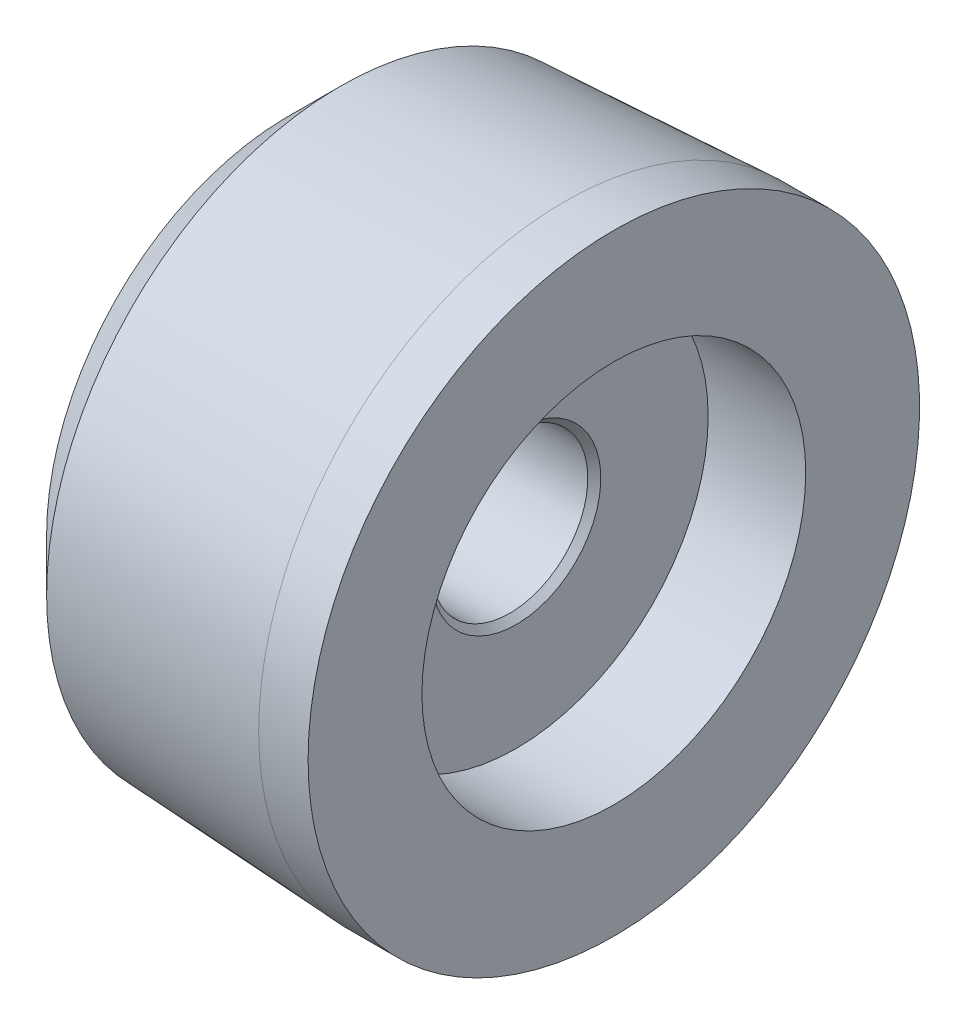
from build123d import *


with BuildPart() as part:
    # Esquisse1 → R_volution1 (revolve)
    with BuildSketch(Plane(origin=(0, 0, 0), x_dir=(-1, 0, 0), z_dir=(0, 0, -1)), mode=Mode.PRIVATE) as r_volution1_sk:
        Polygon((-5, 6.499932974), (-4.50006187, 6), (4.500056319, 6), (5, 6.499938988), (5, 14.75), (12.5, 14.75), (12.5, 18.598586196), (8.5, 22.598586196), (-8.7, 23.5), (-12.5, 23.5), (-12.5, 14.75), (-5, 14.75), align=None)
    revolve(r_volution1_sk.sketch.rotate(Axis((12.5, 0, 0), (-1, 0, 0)), 270), axis=Axis((12.5, 0, 0), (-1, 0, 0)))


solid = part.part
